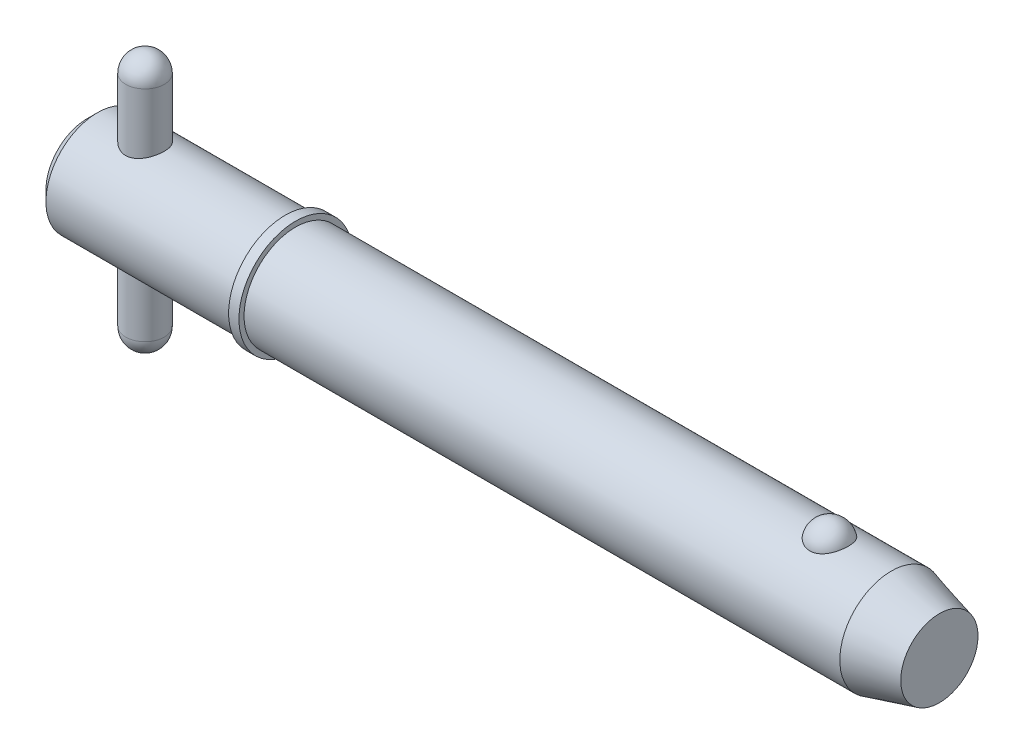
ISO-10303-21;
HEADER;
FILE_DESCRIPTION(('STEP AP214'),'2;1');
FILE_NAME('part.step','',(''),(''),'','','');
FILE_SCHEMA(('AUTOMOTIVE_DESIGN { 1 0 10303 214 1 1 1 1 }'));
ENDSEC;
DATA;
#1=APPLICATION_CONTEXT('core data for automotive mechanical design processes');
#2=APPLICATION_PROTOCOL_DEFINITION('international standard','automotive_design',2000,#1);
#3=PRODUCT_CONTEXT('',#1,'mechanical');
#4=PRODUCT('Part','Part','',(#3));
#5=PRODUCT_RELATED_PRODUCT_CATEGORY('part','',(#4));
#6=PRODUCT_DEFINITION_FORMATION('','',#4);
#7=PRODUCT_DEFINITION_CONTEXT('part definition',#1,'design');
#8=PRODUCT_DEFINITION('design','',#6,#7);
#9=PRODUCT_DEFINITION_SHAPE('','',#8);
#10=(LENGTH_UNIT() NAMED_UNIT(*) SI_UNIT(.MILLI.,.METRE.));
#11=(NAMED_UNIT(*) PLANE_ANGLE_UNIT() SI_UNIT($,.RADIAN.));
#12=(NAMED_UNIT(*) SI_UNIT($,.STERADIAN.) SOLID_ANGLE_UNIT());
#13=UNCERTAINTY_MEASURE_WITH_UNIT(LENGTH_MEASURE(1.E-05),#10,'distance_accuracy_value','');
#14=(GEOMETRIC_REPRESENTATION_CONTEXT(3) GLOBAL_UNCERTAINTY_ASSIGNED_CONTEXT((#13)) GLOBAL_UNIT_ASSIGNED_CONTEXT((#10,
#11,#12)) REPRESENTATION_CONTEXT('',''));
#15=CARTESIAN_POINT('',(0.,0.,0.));
#16=DIRECTION('',(0.,0.,1.));
#17=DIRECTION('',(1.,0.,0.));
#18=AXIS2_PLACEMENT_3D('',#15,#16,#17);
#19=CARTESIAN_POINT('',(7.14,15.875,0.));
#20=DIRECTION('',(0.,-1.,0.));
#21=DIRECTION('',(0.,0.,-1.));
#22=AXIS2_PLACEMENT_3D('',#19,#20,#21);
#23=CYLINDRICAL_SURFACE('',#22,2.38);
#24=CARTESIAN_POINT('',(7.14,-13.495,0.));
#25=DIRECTION('',(0.,-1.,0.));
#26=DIRECTION('',(0.,0.,-1.));
#27=AXIS2_PLACEMENT_3D('',#24,#25,#26);
#28=CIRCLE('',#27,2.38);
#29=CARTESIAN_POINT('',(7.14,-13.495,-2.38));
#30=VERTEX_POINT('',#29);
#31=EDGE_CURVE('P0_E10',#30,#30,#28,.F.);
#32=ORIENTED_EDGE('',*,*,#31,.T.);
#33=EDGE_LOOP('',(#32));
#34=FACE_BOUND('',#33,.T.);
#35=CARTESIAN_POINT('',(7.14,13.495,0.));
#36=DIRECTION('',(0.,-1.,0.));
#37=DIRECTION('',(0.,0.,-1.));
#38=AXIS2_PLACEMENT_3D('',#35,#36,#37);
#39=CIRCLE('',#38,2.38);
#40=CARTESIAN_POINT('',(7.14,13.495,-2.38));
#41=VERTEX_POINT('',#40);
#42=EDGE_CURVE('P0_E21',#41,#41,#39,.T.);
#43=ORIENTED_EDGE('',*,*,#42,.T.);
#44=EDGE_LOOP('',(#43));
#45=FACE_BOUND('',#44,.T.);
#46=ADVANCED_FACE('P0_F14',(#34,#45),#23,.T.);
#47=CARTESIAN_POINT('',(7.14,-13.495,0.));
#48=DIRECTION('',(0.,0.,1.));
#49=DIRECTION('',(1.,0.,0.));
#50=AXIS2_PLACEMENT_3D('',#47,#48,#49);
#51=SPHERICAL_SURFACE('',#50,2.38);
#52=CARTESIAN_POINT('',(7.14,-13.495,0.));
#53=DIRECTION('',(0.,-1.,0.));
#54=DIRECTION('',(0.,0.,-1.));
#55=AXIS2_PLACEMENT_3D('',#52,#53,#54);
#56=SPHERICAL_SURFACE('',#55,2.38);
#57=ORIENTED_EDGE('',*,*,#31,.F.);
#58=EDGE_LOOP('',(#57));
#59=FACE_BOUND('',#58,.T.);
#60=ADVANCED_FACE('P0_F29',(#59),#56,.T.);
#61=CARTESIAN_POINT('',(7.14,13.495,0.));
#62=DIRECTION('',(0.,0.,1.));
#63=DIRECTION('',(1.,0.,0.));
#64=AXIS2_PLACEMENT_3D('',#61,#62,#63);
#65=SPHERICAL_SURFACE('',#64,2.38);
#66=CARTESIAN_POINT('',(7.14,13.495,0.));
#67=DIRECTION('',(0.,-1.,0.));
#68=DIRECTION('',(0.,0.,-1.));
#69=AXIS2_PLACEMENT_3D('',#66,#67,#68);
#70=SPHERICAL_SURFACE('',#69,2.38);
#71=ORIENTED_EDGE('',*,*,#42,.F.);
#72=EDGE_LOOP('',(#71));
#73=FACE_BOUND('',#72,.T.);
#74=ADVANCED_FACE('P0_F16',(#73),#70,.T.);
#75=CLOSED_SHELL('',(#46,#60,#74));
#76=MANIFOLD_SOLID_BREP('P0_B1',#75);
#77=CARTESIAN_POINT('',(0.,0.,0.));
#78=DIRECTION('',(1.,0.,0.));
#79=DIRECTION('',(0.,0.,-1.));
#80=AXIS2_PLACEMENT_3D('',#77,#78,#79);
#81=CYLINDRICAL_SURFACE('',#80,6.35);
#82=CARTESIAN_POINT('',(99.1553693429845,0.,0.));
#83=DIRECTION('',(1.,0.,0.));
#84=DIRECTION('',(0.,0.,-1.));
#85=AXIS2_PLACEMENT_3D('',#82,#83,#84);
#86=CIRCLE('',#85,6.35);
#87=CARTESIAN_POINT('',(99.1553693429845,0.,-6.35));
#88=VERTEX_POINT('',#87);
#89=EDGE_CURVE('P1_E81',#88,#88,#86,.T.);
#90=ORIENTED_EDGE('',*,*,#89,.F.);
#91=EDGE_LOOP('',(#90));
#92=FACE_BOUND('',#91,.T.);
#93=CARTESIAN_POINT('',(25.7,0.,0.));
#94=DIRECTION('',(1.,0.,0.));
#95=DIRECTION('',(0.,0.,-1.));
#96=AXIS2_PLACEMENT_3D('',#93,#94,#95);
#97=CIRCLE('',#96,6.35);
#98=CARTESIAN_POINT('',(25.7,0.,-6.35));
#99=VERTEX_POINT('',#98);
#100=EDGE_CURVE('P1_E85',#99,#99,#97,.T.);
#101=ORIENTED_EDGE('',*,*,#100,.T.);
#102=EDGE_LOOP('',(#101));
#103=FACE_BOUND('',#102,.T.);
#104=CARTESIAN_POINT('',(91.5300214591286,5.87502187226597,2.40969251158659));
#105=CARTESIAN_POINT('',(91.4050305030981,5.87501645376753,2.40969773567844));
#106=CARTESIAN_POINT('',(91.2800806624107,5.87916061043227,2.39967292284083));
#107=CARTESIAN_POINT('',(91.0339091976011,5.8952311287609,2.3599173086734));
#108=CARTESIAN_POINT('',(90.9126863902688,5.90715499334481,2.33019283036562));
#109=CARTESIAN_POINT('',(90.6775170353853,5.93739567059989,2.25201402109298));
#110=CARTESIAN_POINT('',(90.5635602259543,5.95570321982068,2.2035868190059));
#111=CARTESIAN_POINT('',(90.3455735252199,5.99672067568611,2.08937987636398));
#112=CARTESIAN_POINT('',(90.2415457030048,6.01943149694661,2.02359652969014));
#113=CARTESIAN_POINT('',(90.0429437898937,6.06760647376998,1.87428969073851));
#114=CARTESIAN_POINT('',(89.9487268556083,6.09313095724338,1.79031110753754));
#115=CARTESIAN_POINT('',(89.7752557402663,6.14375873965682,1.60800178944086));
#116=CARTESIAN_POINT('',(89.6960043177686,6.16886196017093,1.50966841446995));
#117=CARTESIAN_POINT('',(89.5508457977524,6.21724600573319,1.29645884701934));
#118=CARTESIAN_POINT('',(89.4856885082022,6.24039621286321,1.18104158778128));
#119=CARTESIAN_POINT('',(89.3747035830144,6.28117277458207,0.940351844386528));
#120=CARTESIAN_POINT('',(89.3288776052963,6.29879865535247,0.815078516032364));
#121=CARTESIAN_POINT('',(89.2570234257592,6.32692073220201,0.556494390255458));
#122=CARTESIAN_POINT('',(89.231249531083,6.33732517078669,0.423102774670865));
#123=CARTESIAN_POINT('',(89.2009885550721,6.34957673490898,0.153542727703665));
#124=CARTESIAN_POINT('',(89.1965009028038,6.35142408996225,0.0173743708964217));
#125=CARTESIAN_POINT('',(89.2088655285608,6.34638925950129,-0.253036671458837));
#126=CARTESIAN_POINT('',(89.2255949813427,6.33955731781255,-0.38728593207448));
#127=CARTESIAN_POINT('',(89.279843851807,6.31794129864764,-0.65085123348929));
#128=CARTESIAN_POINT('',(89.3173636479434,6.30315707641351,-0.78016718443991));
#129=CARTESIAN_POINT('',(89.412500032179,6.26711642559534,-1.03041949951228));
#130=CARTESIAN_POINT('',(89.470143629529,6.24585130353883,-1.15134433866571));
#131=CARTESIAN_POINT('',(89.6043522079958,6.19905619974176,-1.38129800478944));
#132=CARTESIAN_POINT('',(89.680918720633,6.17352587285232,-1.49032586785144));
#133=CARTESIAN_POINT('',(89.8517538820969,6.12080227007,-1.69393164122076));
#134=CARTESIAN_POINT('',(89.9461008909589,6.09360200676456,-1.78844209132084));
#135=CARTESIAN_POINT('',(90.1501196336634,6.04070434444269,-1.95970536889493));
#136=CARTESIAN_POINT('',(90.2597900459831,6.01500681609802,-2.03645972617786));
#137=CARTESIAN_POINT('',(90.4891876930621,5.96867714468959,-2.1684564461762));
#138=CARTESIAN_POINT('',(90.6086522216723,5.94794910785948,-2.2241206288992));
#139=CARTESIAN_POINT('',(90.8562188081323,5.91340580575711,-2.31440992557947));
#140=CARTESIAN_POINT('',(90.9843175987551,5.89958794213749,-2.3490429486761));
#141=CARTESIAN_POINT('',(91.238582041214,5.88111049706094,-2.39491590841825));
#142=CARTESIAN_POINT('',(91.3645207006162,5.876025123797,-2.40724512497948));
#143=CARTESIAN_POINT('',(91.6167867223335,5.87428980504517,-2.41147867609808));
#144=CARTESIAN_POINT('',(91.743114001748,5.87763817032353,-2.40338710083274));
#145=CARTESIAN_POINT('',(91.9884170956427,5.89212921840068,-2.36762715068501));
#146=CARTESIAN_POINT('',(92.1074992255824,5.90302431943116,-2.34058030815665));
#147=CARTESIAN_POINT('',(92.3392447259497,5.93113752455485,-2.26839066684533));
#148=CARTESIAN_POINT('',(92.4519075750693,5.94835614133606,-2.2232464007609));
#149=CARTESIAN_POINT('',(92.6704009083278,5.98773016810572,-2.11493806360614));
#150=CARTESIAN_POINT('',(92.776028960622,6.00998499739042,-2.05140269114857));
#151=CARTESIAN_POINT('',(92.9753006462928,6.05690144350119,-1.90842705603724));
#152=CARTESIAN_POINT('',(93.0689415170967,6.08156361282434,-1.8289831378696));
#153=CARTESIAN_POINT('',(93.2466754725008,6.13211715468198,-1.65182429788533));
#154=CARTESIAN_POINT('',(93.330055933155,6.15800825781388,-1.55339381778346));
#155=CARTESIAN_POINT('',(93.4797900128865,6.20712834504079,-1.34374214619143));
#156=CARTESIAN_POINT('',(93.5461405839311,6.23035685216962,-1.23251867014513));
#157=CARTESIAN_POINT('',(93.6623455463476,6.27251177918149,-0.996447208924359));
#158=CARTESIAN_POINT('',(93.7116072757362,6.29127762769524,-0.871278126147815));
#159=CARTESIAN_POINT('',(93.7896142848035,6.3215862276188,-0.613870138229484));
#160=CARTESIAN_POINT('',(93.818359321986,6.33312889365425,-0.481631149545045));
#161=CARTESIAN_POINT('',(93.8547705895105,6.34782349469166,-0.213672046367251));
#162=CARTESIAN_POINT('',(93.8624134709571,6.35096613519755,-0.0779482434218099));
#163=CARTESIAN_POINT('',(93.8563951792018,6.34851322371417,0.19294395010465));
#164=CARTESIAN_POINT('',(93.8427343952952,6.3429178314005,0.328112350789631));
#165=CARTESIAN_POINT('',(93.7945036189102,6.32360512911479,0.593406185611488));
#166=CARTESIAN_POINT('',(93.7600313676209,6.30992579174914,0.723552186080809));
#167=CARTESIAN_POINT('',(93.6709539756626,6.27586325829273,0.975834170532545));
#168=CARTESIAN_POINT('',(93.6163476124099,6.25547965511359,1.09796966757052));
#169=CARTESIAN_POINT('',(93.4877587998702,6.20998183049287,1.33148921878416));
#170=CARTESIAN_POINT('',(93.4136742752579,6.18484288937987,1.44281227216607));
#171=CARTESIAN_POINT('',(93.2478204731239,6.13258735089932,1.65087683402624));
#172=CARTESIAN_POINT('',(93.1560515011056,6.10547078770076,1.74761859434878));
#173=CARTESIAN_POINT('',(92.9571839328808,6.0523587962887,1.92350926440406));
#174=CARTESIAN_POINT('',(92.850133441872,6.0263601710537,2.00271146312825));
#175=CARTESIAN_POINT('',(92.6231384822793,5.97843747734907,2.14154159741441));
#176=CARTESIAN_POINT('',(92.503191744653,5.95651412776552,2.20116608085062));
#177=CARTESIAN_POINT('',(92.2445236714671,5.91812106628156,2.30250570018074));
#178=CARTESIAN_POINT('',(92.1050698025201,5.90217533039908,2.34256795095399));
#179=CARTESIAN_POINT('',(91.8203974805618,5.88063128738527,2.39615214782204));
#180=CARTESIAN_POINT('',(91.6751817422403,5.8750281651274,2.40968644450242));
#181=CARTESIAN_POINT('',(91.5300214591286,5.87502187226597,2.40969251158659));
#182=B_SPLINE_CURVE_WITH_KNOTS('',3,(#104,#105,#106,#107,#108,#109,#110,#111,#112,#113,#114,
#115,#116,#117,#118,#119,#120,#121,#122,#123,#124,#125,#126,#127,#128,#129,#130,#131,#132,#133,
#134,#135,#136,#137,#138,#139,#140,#141,#142,#143,#144,#145,#146,#147,#148,#149,#150,#151,#152,
#153,#154,#155,#156,#157,#158,#159,#160,#161,#162,#163,#164,#165,#166,#167,#168,#169,#170,#171,
#172,#173,#174,#175,#176,#177,#178,#179,#180,#181),.UNSPECIFIED.,.T.,.F.,(4,2,2,2,2,2,2,2,2,2,2,
2,2,2,2,2,2,2,2,2,2,2,2,2,2,2,2,2,2,2,2,2,2,2,2,2,2,2,4),(0.,0.374440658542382,
0.748761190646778,1.12254078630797,1.49639810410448,1.88098871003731,2.26565013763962,
2.66741104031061,3.06920639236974,3.47601794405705,3.88281858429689,4.28727498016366,
4.69173873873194,5.09674745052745,5.50178895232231,5.90865911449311,6.31549420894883,
6.71369855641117,7.11175305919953,7.48978077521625,7.86773278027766,8.2338388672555,
8.59997464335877,8.97409044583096,9.34829231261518,9.74122667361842,10.1342313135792,
10.5397522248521,10.9452779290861,11.3512521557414,11.7572189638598,12.1612938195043,
12.5653932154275,12.9716540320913,13.3779078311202,13.7829098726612,14.1879832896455,
14.6230486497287,15.0579114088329),.UNSPECIFIED.);
#183=CARTESIAN_POINT('',(91.5300214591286,5.87502187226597,2.40969251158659));
#184=VERTEX_POINT('',#183);
#185=EDGE_CURVE('P1_E35',#184,#184,#182,.T.);
#186=ORIENTED_EDGE('',*,*,#185,.T.);
#187=EDGE_LOOP('',(#186));
#188=FACE_BOUND('',#187,.T.);
#189=ADVANCED_FACE('P1_F13',(#92,#103,#188),#81,.T.);
#190=CARTESIAN_POINT('',(0.,0.,0.));
#191=DIRECTION('',(-1.,0.,0.));
#192=DIRECTION('',(0.,0.,1.));
#193=AXIS2_PLACEMENT_3D('',#190,#191,#192);
#194=PLANE('',#193);
#195=CARTESIAN_POINT('',(0.,0.,0.));
#196=DIRECTION('',(1.,0.,0.));
#197=DIRECTION('',(0.,0.,-1.));
#198=AXIS2_PLACEMENT_3D('',#195,#196,#197);
#199=CIRCLE('',#198,5.08);
#200=CARTESIAN_POINT('',(0.,0.,-5.08));
#201=VERTEX_POINT('',#200);
#202=EDGE_CURVE('P1_E9',#201,#201,#199,.T.);
#203=ORIENTED_EDGE('',*,*,#202,.F.);
#204=EDGE_LOOP('',(#203));
#205=FACE_BOUND('',#204,.T.);
#206=ADVANCED_FACE('P1_F15',(#205),#194,.T.);
#207=CARTESIAN_POINT('',(1.27,0.,0.));
#208=DIRECTION('',(1.,0.,0.));
#209=DIRECTION('',(0.,0.,-1.));
#210=AXIS2_PLACEMENT_3D('',#207,#208,#209);
#211=CONICAL_SURFACE('',#210,6.35,0.78539816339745);
#212=ORIENTED_EDGE('',*,*,#202,.T.);
#213=EDGE_LOOP('',(#212));
#214=FACE_BOUND('',#213,.T.);
#215=CARTESIAN_POINT('',(1.27,0.,0.));
#216=DIRECTION('',(1.,0.,0.));
#217=DIRECTION('',(0.,0.,-1.));
#218=AXIS2_PLACEMENT_3D('',#215,#216,#217);
#219=CIRCLE('',#218,6.35);
#220=CARTESIAN_POINT('',(1.27,0.,-6.35));
#221=VERTEX_POINT('',#220);
#222=EDGE_CURVE('P1_E26',#221,#221,#219,.T.);
#223=ORIENTED_EDGE('',*,*,#222,.F.);
#224=EDGE_LOOP('',(#223));
#225=FACE_BOUND('',#224,.T.);
#226=ADVANCED_FACE('P1_F77',(#214,#225),#211,.T.);
#227=CARTESIAN_POINT('',(0.,0.,0.));
#228=DIRECTION('',(1.,0.,0.));
#229=DIRECTION('',(0.,0.,-1.));
#230=AXIS2_PLACEMENT_3D('',#227,#228,#229);
#231=CYLINDRICAL_SURFACE('',#230,6.35);
#232=CARTESIAN_POINT('',(7.14,-5.88711304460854,2.38));
#233=CARTESIAN_POINT('',(7.01146258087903,-5.88710856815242,2.38000480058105));
#234=CARTESIAN_POINT('',(6.88295682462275,-5.89136840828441,2.36955244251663));
#235=CARTESIAN_POINT('',(6.62981934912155,-5.90782785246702,2.32820953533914));
#236=CARTESIAN_POINT('',(6.50518751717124,-5.92002722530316,2.29731958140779));
#237=CARTESIAN_POINT('',(6.26352403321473,-5.95079384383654,2.21639366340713));
#238=CARTESIAN_POINT('',(6.14647496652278,-5.96934583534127,2.16640353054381));
#239=CARTESIAN_POINT('',(5.92237941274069,-6.01070278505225,2.04885862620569));
#240=CARTESIAN_POINT('',(5.81533593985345,-6.03350901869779,1.98129858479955));
#241=CARTESIAN_POINT('',(5.60897525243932,-6.08207341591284,1.82693902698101));
#242=CARTESIAN_POINT('',(5.51022503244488,-6.10791836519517,1.73940861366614));
#243=CARTESIAN_POINT('',(5.32840561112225,-6.15892405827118,1.54914379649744));
#244=CARTESIAN_POINT('',(5.24533975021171,-6.1840846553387,1.44640616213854));
#245=CARTESIAN_POINT('',(5.09451639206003,-6.23191821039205,1.22434014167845));
#246=CARTESIAN_POINT('',(5.02737511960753,-6.25447755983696,1.10456656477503));
#247=CARTESIAN_POINT('',(4.91443001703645,-6.2935236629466,0.854429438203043));
#248=CARTESIAN_POINT('',(4.86861879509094,-6.31001251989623,0.724069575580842));
#249=CARTESIAN_POINT('',(4.80162253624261,-6.33444370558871,0.46242122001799));
#250=CARTESIAN_POINT('',(4.77946137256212,-6.34272370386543,0.331414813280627));
#251=CARTESIAN_POINT('',(4.75726677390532,-6.35101600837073,0.0672982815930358));
#252=CARTESIAN_POINT('',(4.75722615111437,-6.35103100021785,-0.0658111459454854));
#253=CARTESIAN_POINT('',(4.77870510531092,-6.3430064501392,-0.323358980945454));
#254=CARTESIAN_POINT('',(4.79915922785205,-6.33536494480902,-0.447900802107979));
#255=CARTESIAN_POINT('',(4.85925493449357,-6.31340794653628,-0.69163609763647));
#256=CARTESIAN_POINT('',(4.89889787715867,-6.29909198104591,-0.810829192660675));
#257=CARTESIAN_POINT('',(4.9967414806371,-6.26494471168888,-1.04254212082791));
#258=CARTESIAN_POINT('',(5.05520370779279,-6.24503620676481,-1.1549396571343));
#259=CARTESIAN_POINT('',(5.1887948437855,-6.20171869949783,-1.3686079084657));
#260=CARTESIAN_POINT('',(5.26392912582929,-6.17830856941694,-1.46987502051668));
#261=CARTESIAN_POINT('',(5.43386591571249,-6.12878580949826,-1.66468415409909));
#262=CARTESIAN_POINT('',(5.52956139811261,-6.10259519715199,-1.75742857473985));
#263=CARTESIAN_POINT('',(5.73530435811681,-6.05155777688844,-1.92585331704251));
#264=CARTESIAN_POINT('',(5.84535542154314,-6.02671130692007,-2.00152936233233));
#265=CARTESIAN_POINT('',(6.07982989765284,-5.98068420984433,-2.13519109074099));
#266=CARTESIAN_POINT('',(6.20451768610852,-5.95959698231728,-2.19274775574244));
#267=CARTESIAN_POINT('',(6.4628145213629,-5.92455622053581,-2.28574558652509));
#268=CARTESIAN_POINT('',(6.59641856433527,-5.91059872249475,-2.32119904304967));
#269=CARTESIAN_POINT('',(6.86087441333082,-5.8923327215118,-2.36717069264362));
#270=CARTESIAN_POINT('',(6.99147192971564,-5.8875347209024,-2.37895573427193));
#271=CARTESIAN_POINT('',(7.25283805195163,-5.88674545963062,-2.38091046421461));
#272=CARTESIAN_POINT('',(7.38360660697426,-5.89075200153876,-2.37108554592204));
#273=CARTESIAN_POINT('',(7.63510696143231,-5.90662331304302,-2.33124781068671));
#274=CARTESIAN_POINT('',(7.75602069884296,-5.91810660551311,-2.30221396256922));
#275=CARTESIAN_POINT('',(7.99120505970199,-5.94718527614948,-2.22601401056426));
#276=CARTESIAN_POINT('',(8.10547431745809,-5.96478190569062,-2.17884419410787));
#277=CARTESIAN_POINT('',(8.32888632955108,-6.00491533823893,-2.06572311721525));
#278=CARTESIAN_POINT('',(8.43767672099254,-6.02761250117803,-1.99913452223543));
#279=CARTESIAN_POINT('',(8.6429894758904,-6.07511988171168,-1.84974438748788));
#280=CARTESIAN_POINT('',(8.73950733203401,-6.09993087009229,-1.76693691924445));
#281=CARTESIAN_POINT('',(8.9238741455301,-6.1507686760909,-1.58125563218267));
#282=CARTESIAN_POINT('',(9.01078732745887,-6.17677301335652,-1.47744327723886));
#283=CARTESIAN_POINT('',(9.16607127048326,-6.22556172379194,-1.25606967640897));
#284=CARTESIAN_POINT('',(9.23444197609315,-6.24834608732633,-1.13850838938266));
#285=CARTESIAN_POINT('',(9.3502493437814,-6.28811144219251,-0.893050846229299));
#286=CARTESIAN_POINT('',(9.39775808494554,-6.30511236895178,-0.765192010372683));
#287=CARTESIAN_POINT('',(9.47032640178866,-6.33145833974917,-0.502514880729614));
#288=CARTESIAN_POINT('',(9.49539651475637,-6.34080697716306,-0.367699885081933));
#289=CARTESIAN_POINT('',(9.52124059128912,-6.35045496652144,-0.103396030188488));
#290=CARTESIAN_POINT('',(9.52334421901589,-6.35124952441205,0.025945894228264));
#291=CARTESIAN_POINT('',(9.50661518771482,-6.34499064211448,0.283061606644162));
#292=CARTESIAN_POINT('',(9.48778504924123,-6.33793814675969,0.410835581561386));
#293=CARTESIAN_POINT('',(9.43065630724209,-6.31700307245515,0.658028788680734));
#294=CARTESIAN_POINT('',(9.39284291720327,-6.30329098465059,0.7775756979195));
#295=CARTESIAN_POINT('',(9.29930406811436,-6.27046903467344,1.00863789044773));
#296=CARTESIAN_POINT('',(9.2435752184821,-6.25135815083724,1.12015164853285));
#297=CARTESIAN_POINT('',(9.11312349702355,-6.20865254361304,1.33711407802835));
#298=CARTESIAN_POINT('',(9.03770094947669,-6.18490316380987,1.44211105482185));
#299=CARTESIAN_POINT('',(8.87110640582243,-6.13583718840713,1.63836897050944));
#300=CARTESIAN_POINT('',(8.77992879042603,-6.11052003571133,1.72962498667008));
#301=CARTESIAN_POINT('',(8.57869799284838,-6.05953829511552,1.90076098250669));
#302=CARTESIAN_POINT('',(8.46790320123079,-6.03392573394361,1.97978778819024));
#303=CARTESIAN_POINT('',(8.23379693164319,-5.98676607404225,2.11813466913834));
#304=CARTESIAN_POINT('',(8.11048418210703,-5.9652193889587,2.17745273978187));
#305=CARTESIAN_POINT('',(7.84900037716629,-5.92818393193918,2.27641807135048));
#306=CARTESIAN_POINT('',(7.71041678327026,-5.91299857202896,2.31510015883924));
#307=CARTESIAN_POINT('',(7.42787316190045,-5.89246887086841,2.36688002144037));
#308=CARTESIAN_POINT('',(7.28391673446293,-5.88711805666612,2.37999462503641));
#309=CARTESIAN_POINT('',(7.14,-5.88711304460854,2.38));
#310=B_SPLINE_CURVE_WITH_KNOTS('',3,(#232,#233,#234,#235,#236,#237,#238,#239,#240,#241,#242,
#243,#244,#245,#246,#247,#248,#249,#250,#251,#252,#253,#254,#255,#256,#257,#258,#259,#260,#261,
#262,#263,#264,#265,#266,#267,#268,#269,#270,#271,#272,#273,#274,#275,#276,#277,#278,#279,#280,
#281,#282,#283,#284,#285,#286,#287,#288,#289,#290,#291,#292,#293,#294,#295,#296,#297,#298,#299,
#300,#301,#302,#303,#304,#305,#306,#307,#308,#309),.UNSPECIFIED.,.T.,.F.,(4,2,2,2,2,2,2,2,2,2,2,
2,2,2,2,2,2,2,2,2,2,2,2,2,2,2,2,2,2,2,2,2,2,2,2,2,2,2,4),(0.,0.385076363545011,
0.770141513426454,1.15428843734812,1.53855071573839,1.94016118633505,2.3418570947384,
2.75720522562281,3.1724093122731,3.569721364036,3.96690431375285,4.34445758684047,
4.72203759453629,5.10511017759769,5.48830640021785,5.89390240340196,6.29959991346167,
6.71428455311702,7.12873839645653,7.52034494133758,7.91185376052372,8.28480528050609,
8.65783318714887,9.0448340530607,9.43197664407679,9.84363087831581,10.2552863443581,
10.6655081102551,11.0755371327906,11.4616919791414,11.847800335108,12.224507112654,
12.6012852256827,12.9938941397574,13.386643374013,13.8000944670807,14.2135876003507,
14.6450218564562,15.0761720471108),.UNSPECIFIED.);
#311=CARTESIAN_POINT('',(7.14,-5.88711304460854,2.38));
#312=VERTEX_POINT('',#311);
#313=EDGE_CURVE('P1_E17',#312,#312,#310,.T.);
#314=ORIENTED_EDGE('',*,*,#313,.F.);
#315=EDGE_LOOP('',(#314));
#316=FACE_BOUND('',#315,.T.);
#317=CARTESIAN_POINT('',(7.14,5.88711304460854,2.38));
#318=CARTESIAN_POINT('',(7.26853741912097,5.88710856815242,2.38000480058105));
#319=CARTESIAN_POINT('',(7.39704317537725,5.89136840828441,2.36955244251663));
#320=CARTESIAN_POINT('',(7.65018065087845,5.90782785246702,2.32820953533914));
#321=CARTESIAN_POINT('',(7.77481248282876,5.92002722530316,2.29731958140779));
#322=CARTESIAN_POINT('',(8.01647596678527,5.95079384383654,2.21639366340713));
#323=CARTESIAN_POINT('',(8.13352503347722,5.96934583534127,2.16640353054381));
#324=CARTESIAN_POINT('',(8.35762058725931,6.01070278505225,2.04885862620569));
#325=CARTESIAN_POINT('',(8.46466406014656,6.03350901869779,1.98129858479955));
#326=CARTESIAN_POINT('',(8.67102474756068,6.08207341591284,1.82693902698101));
#327=CARTESIAN_POINT('',(8.76977496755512,6.10791836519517,1.73940861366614));
#328=CARTESIAN_POINT('',(8.95159438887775,6.15892405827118,1.54914379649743));
#329=CARTESIAN_POINT('',(9.03466024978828,6.1840846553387,1.44640616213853));
#330=CARTESIAN_POINT('',(9.18548360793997,6.23191821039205,1.22434014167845));
#331=CARTESIAN_POINT('',(9.25262488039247,6.25447755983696,1.10456656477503));
#332=CARTESIAN_POINT('',(9.36556998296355,6.2935236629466,0.854429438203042));
#333=CARTESIAN_POINT('',(9.41138120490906,6.31001251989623,0.72406957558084));
#334=CARTESIAN_POINT('',(9.47837746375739,6.33444370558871,0.462421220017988));
#335=CARTESIAN_POINT('',(9.50053862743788,6.34272370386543,0.331414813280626));
#336=CARTESIAN_POINT('',(9.52273322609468,6.35101600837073,0.0672982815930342));
#337=CARTESIAN_POINT('',(9.52277384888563,6.35103100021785,-0.0658111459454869));
#338=CARTESIAN_POINT('',(9.50129489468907,6.3430064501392,-0.323358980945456));
#339=CARTESIAN_POINT('',(9.48084077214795,6.33536494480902,-0.447900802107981));
#340=CARTESIAN_POINT('',(9.42074506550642,6.31340794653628,-0.691636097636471));
#341=CARTESIAN_POINT('',(9.38110212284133,6.29909198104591,-0.810829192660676));
#342=CARTESIAN_POINT('',(9.2832585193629,6.26494471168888,-1.04254212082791));
#343=CARTESIAN_POINT('',(9.22479629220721,6.24503620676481,-1.1549396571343));
#344=CARTESIAN_POINT('',(9.0912051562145,6.20171869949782,-1.3686079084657));
#345=CARTESIAN_POINT('',(9.0160708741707,6.17830856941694,-1.46987502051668));
#346=CARTESIAN_POINT('',(8.84613408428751,6.12878580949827,-1.66468415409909));
#347=CARTESIAN_POINT('',(8.75043860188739,6.10259519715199,-1.75742857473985));
#348=CARTESIAN_POINT('',(8.54469564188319,6.05155777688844,-1.92585331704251));
#349=CARTESIAN_POINT('',(8.43464457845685,6.02671130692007,-2.00152936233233));
#350=CARTESIAN_POINT('',(8.20017010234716,5.98068420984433,-2.13519109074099));
#351=CARTESIAN_POINT('',(8.07548231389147,5.95959698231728,-2.19274775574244));
#352=CARTESIAN_POINT('',(7.8171854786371,5.9245562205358,-2.28574558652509));
#353=CARTESIAN_POINT('',(7.68358143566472,5.91059872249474,-2.32119904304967));
#354=CARTESIAN_POINT('',(7.41912558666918,5.8923327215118,-2.36717069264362));
#355=CARTESIAN_POINT('',(7.28852807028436,5.8875347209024,-2.37895573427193));
#356=CARTESIAN_POINT('',(7.02716194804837,5.88674545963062,-2.38091046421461));
#357=CARTESIAN_POINT('',(6.89639339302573,5.89075200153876,-2.37108554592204));
#358=CARTESIAN_POINT('',(6.64489303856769,5.90662331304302,-2.33124781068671));
#359=CARTESIAN_POINT('',(6.52397930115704,5.91810660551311,-2.30221396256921));
#360=CARTESIAN_POINT('',(6.288794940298,5.94718527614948,-2.22601401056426));
#361=CARTESIAN_POINT('',(6.17452568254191,5.96478190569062,-2.17884419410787));
#362=CARTESIAN_POINT('',(5.95111367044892,6.00491533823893,-2.06572311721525));
#363=CARTESIAN_POINT('',(5.84232327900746,6.02761250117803,-1.99913452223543));
#364=CARTESIAN_POINT('',(5.6370105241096,6.07511988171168,-1.84974438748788));
#365=CARTESIAN_POINT('',(5.54049266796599,6.09993087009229,-1.76693691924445));
#366=CARTESIAN_POINT('',(5.3561258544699,6.1507686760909,-1.58125563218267));
#367=CARTESIAN_POINT('',(5.26921267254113,6.17677301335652,-1.47744327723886));
#368=CARTESIAN_POINT('',(5.11392872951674,6.22556172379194,-1.25606967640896));
#369=CARTESIAN_POINT('',(5.04555802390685,6.24834608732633,-1.13850838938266));
#370=CARTESIAN_POINT('',(4.9297506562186,6.28811144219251,-0.893050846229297));
#371=CARTESIAN_POINT('',(4.88224191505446,6.30511236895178,-0.76519201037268));
#372=CARTESIAN_POINT('',(4.80967359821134,6.33145833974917,-0.502514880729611));
#373=CARTESIAN_POINT('',(4.78460348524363,6.34080697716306,-0.36769988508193));
#374=CARTESIAN_POINT('',(4.75875940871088,6.35045496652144,-0.103396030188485));
#375=CARTESIAN_POINT('',(4.75665578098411,6.35124952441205,0.025945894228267));
#376=CARTESIAN_POINT('',(4.77338481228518,6.34499064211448,0.283061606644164));
#377=CARTESIAN_POINT('',(4.79221495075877,6.33793814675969,0.410835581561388));
#378=CARTESIAN_POINT('',(4.84934369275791,6.31700307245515,0.658028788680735));
#379=CARTESIAN_POINT('',(4.88715708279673,6.30329098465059,0.777575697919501));
#380=CARTESIAN_POINT('',(4.98069593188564,6.27046903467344,1.00863789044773));
#381=CARTESIAN_POINT('',(5.0364247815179,6.25135815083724,1.12015164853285));
#382=CARTESIAN_POINT('',(5.16687650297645,6.20865254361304,1.33711407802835));
#383=CARTESIAN_POINT('',(5.24229905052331,6.18490316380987,1.44211105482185));
#384=CARTESIAN_POINT('',(5.40889359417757,6.13583718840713,1.63836897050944));
#385=CARTESIAN_POINT('',(5.50007120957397,6.11052003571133,1.72962498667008));
#386=CARTESIAN_POINT('',(5.70130200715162,6.05953829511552,1.90076098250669));
#387=CARTESIAN_POINT('',(5.81209679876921,6.03392573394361,1.97978778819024));
#388=CARTESIAN_POINT('',(6.04620306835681,5.98676607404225,2.11813466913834));
#389=CARTESIAN_POINT('',(6.16951581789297,5.9652193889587,2.17745273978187));
#390=CARTESIAN_POINT('',(6.43099962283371,5.92818393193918,2.27641807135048));
#391=CARTESIAN_POINT('',(6.56958321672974,5.91299857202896,2.31510015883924));
#392=CARTESIAN_POINT('',(6.85212683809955,5.89246887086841,2.36688002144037));
#393=CARTESIAN_POINT('',(6.99608326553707,5.88711805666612,2.37999462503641));
#394=CARTESIAN_POINT('',(7.14,5.88711304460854,2.38));
#395=B_SPLINE_CURVE_WITH_KNOTS('',3,(#317,#318,#319,#320,#321,#322,#323,#324,#325,#326,#327,
#328,#329,#330,#331,#332,#333,#334,#335,#336,#337,#338,#339,#340,#341,#342,#343,#344,#345,#346,
#347,#348,#349,#350,#351,#352,#353,#354,#355,#356,#357,#358,#359,#360,#361,#362,#363,#364,#365,
#366,#367,#368,#369,#370,#371,#372,#373,#374,#375,#376,#377,#378,#379,#380,#381,#382,#383,#384,
#385,#386,#387,#388,#389,#390,#391,#392,#393,#394),.UNSPECIFIED.,.T.,.F.,(4,2,2,2,2,2,2,2,2,2,2,
2,2,2,2,2,2,2,2,2,2,2,2,2,2,2,2,2,2,2,2,2,2,2,2,2,2,2,4),(0.,0.385076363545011,
0.770141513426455,1.15428843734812,1.53855071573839,1.94016118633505,2.3418570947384,
2.75720522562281,3.1724093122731,3.56972136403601,3.96690431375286,4.34445758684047,
4.72203759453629,5.10511017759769,5.48830640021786,5.89390240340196,6.29959991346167,
6.71428455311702,7.12873839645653,7.52034494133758,7.91185376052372,8.2848052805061,
8.65783318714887,9.0448340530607,9.43197664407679,9.84363087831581,10.2552863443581,
10.6655081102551,11.0755371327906,11.4616919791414,11.847800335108,12.2245071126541,
12.6012852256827,12.9938941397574,13.386643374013,13.8000944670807,14.2135876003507,
14.6450218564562,15.0761720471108),.UNSPECIFIED.);
#396=CARTESIAN_POINT('',(7.14,5.88711304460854,2.38));
#397=VERTEX_POINT('',#396);
#398=EDGE_CURVE('P1_E43',#397,#397,#395,.T.);
#399=ORIENTED_EDGE('',*,*,#398,.F.);
#400=EDGE_LOOP('',(#399));
#401=FACE_BOUND('',#400,.T.);
#402=ORIENTED_EDGE('',*,*,#222,.T.);
#403=EDGE_LOOP('',(#402));
#404=FACE_BOUND('',#403,.T.);
#405=CARTESIAN_POINT('',(24.43,0.,0.));
#406=DIRECTION('',(1.,0.,0.));
#407=DIRECTION('',(0.,0.,-1.));
#408=AXIS2_PLACEMENT_3D('',#405,#406,#407);
#409=CIRCLE('',#408,6.35);
#410=CARTESIAN_POINT('',(24.43,0.,-6.35));
#411=VERTEX_POINT('',#410);
#412=EDGE_CURVE('P1_E31',#411,#411,#409,.T.);
#413=ORIENTED_EDGE('',*,*,#412,.F.);
#414=EDGE_LOOP('',(#413));
#415=FACE_BOUND('',#414,.T.);
#416=ADVANCED_FACE('P1_F103',(#316,#401,#404,#415),#231,.T.);
#417=CARTESIAN_POINT('',(24.43,6.35,0.));
#418=DIRECTION('',(-1.,0.,0.));
#419=DIRECTION('',(0.,0.,1.));
#420=AXIS2_PLACEMENT_3D('',#417,#418,#419);
#421=PLANE('',#420);
#422=ORIENTED_EDGE('',*,*,#412,.T.);
#423=EDGE_LOOP('',(#422));
#424=FACE_BOUND('',#423,.T.);
#425=CARTESIAN_POINT('',(24.43,0.,0.));
#426=DIRECTION('',(1.,0.,0.));
#427=DIRECTION('',(0.,0.,-1.));
#428=AXIS2_PLACEMENT_3D('',#425,#426,#427);
#429=CIRCLE('',#428,6.985);
#430=CARTESIAN_POINT('',(24.43,0.,-6.985));
#431=VERTEX_POINT('',#430);
#432=EDGE_CURVE('P1_E91',#431,#431,#429,.T.);
#433=ORIENTED_EDGE('',*,*,#432,.F.);
#434=EDGE_LOOP('',(#433));
#435=FACE_BOUND('',#434,.T.);
#436=ADVANCED_FACE('P1_F100',(#424,#435),#421,.T.);
#437=CARTESIAN_POINT('',(0.,0.,0.));
#438=DIRECTION('',(1.,0.,0.));
#439=DIRECTION('',(0.,0.,-1.));
#440=AXIS2_PLACEMENT_3D('',#437,#438,#439);
#441=CYLINDRICAL_SURFACE('',#440,6.985);
#442=ORIENTED_EDGE('',*,*,#432,.T.);
#443=EDGE_LOOP('',(#442));
#444=FACE_BOUND('',#443,.T.);
#445=CARTESIAN_POINT('',(25.7,0.,0.));
#446=DIRECTION('',(1.,0.,0.));
#447=DIRECTION('',(0.,0.,-1.));
#448=AXIS2_PLACEMENT_3D('',#445,#446,#447);
#449=CIRCLE('',#448,6.985);
#450=CARTESIAN_POINT('',(25.7,0.,-6.985));
#451=VERTEX_POINT('',#450);
#452=EDGE_CURVE('P1_E88',#451,#451,#449,.T.);
#453=ORIENTED_EDGE('',*,*,#452,.F.);
#454=EDGE_LOOP('',(#453));
#455=FACE_BOUND('',#454,.T.);
#456=ADVANCED_FACE('P1_F68',(#444,#455),#441,.T.);
#457=CARTESIAN_POINT('',(25.7,6.985,0.));
#458=DIRECTION('',(1.,0.,0.));
#459=DIRECTION('',(0.,0.,-1.));
#460=AXIS2_PLACEMENT_3D('',#457,#458,#459);
#461=PLANE('',#460);
#462=ORIENTED_EDGE('',*,*,#452,.T.);
#463=EDGE_LOOP('',(#462));
#464=FACE_BOUND('',#463,.T.);
#465=ORIENTED_EDGE('',*,*,#100,.F.);
#466=EDGE_LOOP('',(#465));
#467=FACE_BOUND('',#466,.T.);
#468=ADVANCED_FACE('P1_F62',(#464,#467),#461,.T.);
#469=CARTESIAN_POINT('',(105.08,0.,0.));
#470=DIRECTION('',(-1.,0.,0.));
#471=DIRECTION('',(0.,0.,1.));
#472=AXIS2_PLACEMENT_3D('',#469,#470,#471);
#473=CONICAL_SURFACE('',#472,4.76250000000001,0.26179938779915);
#474=ORIENTED_EDGE('',*,*,#89,.T.);
#475=EDGE_LOOP('',(#474));
#476=FACE_BOUND('',#475,.T.);
#477=CARTESIAN_POINT('',(105.08,0.,0.));
#478=DIRECTION('',(1.,0.,0.));
#479=DIRECTION('',(0.,0.,-1.));
#480=AXIS2_PLACEMENT_3D('',#477,#478,#479);
#481=CIRCLE('',#480,4.76250000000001);
#482=CARTESIAN_POINT('',(105.08,0.,-4.76250000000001));
#483=VERTEX_POINT('',#482);
#484=EDGE_CURVE('P1_E42',#483,#483,#481,.T.);
#485=ORIENTED_EDGE('',*,*,#484,.F.);
#486=EDGE_LOOP('',(#485));
#487=FACE_BOUND('',#486,.T.);
#488=ADVANCED_FACE('P1_F59',(#476,#487),#473,.T.);
#489=CARTESIAN_POINT('',(105.08,4.76250000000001,0.));
#490=DIRECTION('',(1.,0.,0.));
#491=DIRECTION('',(0.,0.,-1.));
#492=AXIS2_PLACEMENT_3D('',#489,#490,#491);
#493=PLANE('',#492);
#494=ORIENTED_EDGE('',*,*,#484,.T.);
#495=EDGE_LOOP('',(#494));
#496=FACE_BOUND('',#495,.T.);
#497=ADVANCED_FACE('P1_F55',(#496),#493,.T.);
#498=CARTESIAN_POINT('',(91.5300214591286,5.715,0.));
#499=DIRECTION('',(-1.,0.,0.));
#500=DIRECTION('',(0.,1.,0.));
#501=AXIS2_PLACEMENT_3D('',#498,#499,#500);
#502=SPHERICAL_SURFACE('',#501,2.415);
#503=ORIENTED_EDGE('',*,*,#185,.F.);
#504=EDGE_LOOP('',(#503));
#505=FACE_BOUND('',#504,.T.);
#506=ADVANCED_FACE('P1_F50',(#505),#502,.T.);
#507=CARTESIAN_POINT('',(7.14,-6.985,0.));
#508=DIRECTION('',(0.,1.,0.));
#509=DIRECTION('',(0.,0.,1.));
#510=AXIS2_PLACEMENT_3D('',#507,#508,#509);
#511=CYLINDRICAL_SURFACE('',#510,2.38);
#512=ORIENTED_EDGE('',*,*,#313,.T.);
#513=EDGE_LOOP('',(#512));
#514=FACE_BOUND('',#513,.T.);
#515=ORIENTED_EDGE('',*,*,#398,.T.);
#516=EDGE_LOOP('',(#515));
#517=FACE_BOUND('',#516,.T.);
#518=ADVANCED_FACE('P1_F54',(#514,#517),#511,.F.);
#519=CLOSED_SHELL('',(#189,#206,#226,#416,#436,#456,#468,#488,#497,#506,#518));
#520=MANIFOLD_SOLID_BREP('P1_B1',#519);
#521=ADVANCED_BREP_SHAPE_REPRESENTATION('',(#18,#76,#520),#14);
#522=SHAPE_DEFINITION_REPRESENTATION(#9,#521);
ENDSEC;
END-ISO-10303-21;
